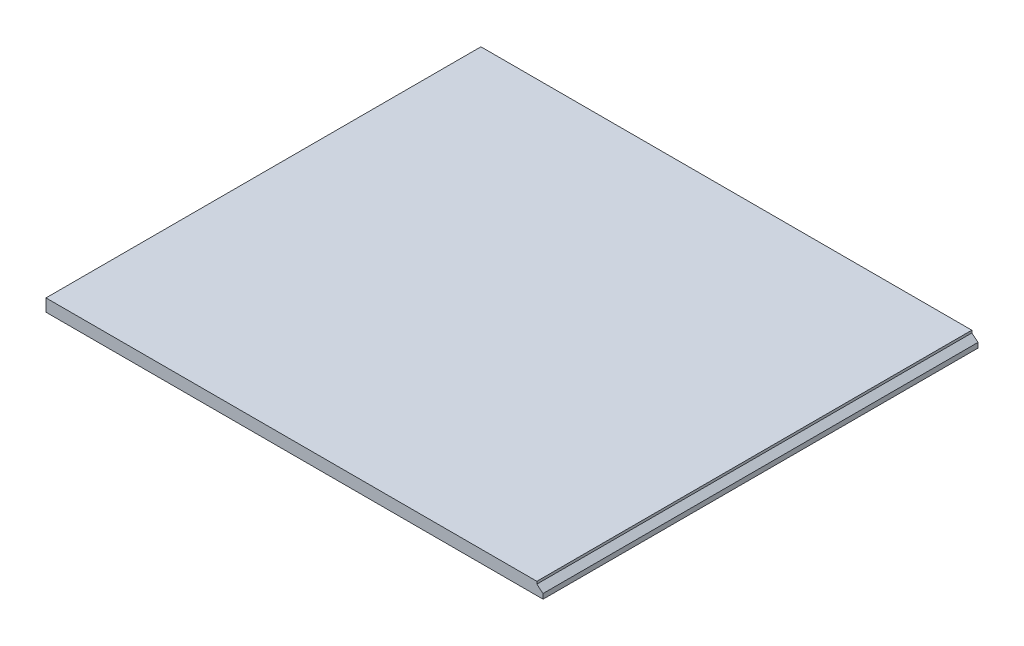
ISO-10303-21;
HEADER;
FILE_DESCRIPTION(('STEP AP214'),'2;1');
FILE_NAME('part.step','',(''),(''),'','','');
FILE_SCHEMA(('AUTOMOTIVE_DESIGN { 1 0 10303 214 1 1 1 1 }'));
ENDSEC;
DATA;
#1=APPLICATION_CONTEXT('core data for automotive mechanical design processes');
#2=APPLICATION_PROTOCOL_DEFINITION('international standard','automotive_design',2000,#1);
#3=PRODUCT_CONTEXT('',#1,'mechanical');
#4=PRODUCT('Part','Part','',(#3));
#5=PRODUCT_RELATED_PRODUCT_CATEGORY('part','',(#4));
#6=PRODUCT_DEFINITION_FORMATION('','',#4);
#7=PRODUCT_DEFINITION_CONTEXT('part definition',#1,'design');
#8=PRODUCT_DEFINITION('design','',#6,#7);
#9=PRODUCT_DEFINITION_SHAPE('','',#8);
#10=(LENGTH_UNIT() NAMED_UNIT(*) SI_UNIT(.MILLI.,.METRE.));
#11=(NAMED_UNIT(*) PLANE_ANGLE_UNIT() SI_UNIT($,.RADIAN.));
#12=(NAMED_UNIT(*) SI_UNIT($,.STERADIAN.) SOLID_ANGLE_UNIT());
#13=UNCERTAINTY_MEASURE_WITH_UNIT(LENGTH_MEASURE(1.E-05),#10,'distance_accuracy_value','');
#14=(GEOMETRIC_REPRESENTATION_CONTEXT(3) GLOBAL_UNCERTAINTY_ASSIGNED_CONTEXT((#13)) GLOBAL_UNIT_ASSIGNED_CONTEXT((#10,
#11,#12)) REPRESENTATION_CONTEXT('',''));
#15=CARTESIAN_POINT('',(0.,0.,0.));
#16=DIRECTION('',(0.,0.,1.));
#17=DIRECTION('',(1.,0.,0.));
#18=AXIS2_PLACEMENT_3D('',#15,#16,#17);
#19=CARTESIAN_POINT('',(1.22464679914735E-13,-1000.,5000.));
#20=DIRECTION('',(0.,1.,0.));
#21=DIRECTION('',(0.,0.,1.));
#22=AXIS2_PLACEMENT_3D('',#19,#20,#21);
#23=PLANE('',#22);
#24=DIRECTION('',(0.,0.,-1.));
#25=VECTOR('',#24,1.);
#26=CARTESIAN_POINT('',(1.22464679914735E-13,-1000.,5000.));
#27=LINE('',#26,#25);
#28=CARTESIAN_POINT('',(1.22464679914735E-13,-1000.,5000.));
#29=VERTEX_POINT('',#28);
#30=CARTESIAN_POINT('',(1.22464679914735E-13,-1000.,-30000.));
#31=VERTEX_POINT('',#30);
#32=EDGE_CURVE('E51',#29,#31,#27,.T.);
#33=ORIENTED_EDGE('',*,*,#32,.T.);
#34=DIRECTION('',(1.,0.,0.));
#35=VECTOR('',#34,1.);
#36=CARTESIAN_POINT('',(1.22464679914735E-13,-1000.,-30000.));
#37=LINE('',#36,#35);
#38=CARTESIAN_POINT('',(40000.,-1000.,-30000.));
#39=VERTEX_POINT('',#38);
#40=EDGE_CURVE('E165',#31,#39,#37,.T.);
#41=ORIENTED_EDGE('',*,*,#40,.T.);
#42=DIRECTION('',(0.,0.,-1.));
#43=VECTOR('',#42,1.);
#44=CARTESIAN_POINT('',(40000.,-1000.,5000.));
#45=LINE('',#44,#43);
#46=CARTESIAN_POINT('',(40000.,-1000.,5000.));
#47=VERTEX_POINT('',#46);
#48=EDGE_CURVE('E194',#47,#39,#45,.T.);
#49=ORIENTED_EDGE('',*,*,#48,.F.);
#50=DIRECTION('',(1.,0.,0.));
#51=VECTOR('',#50,1.);
#52=CARTESIAN_POINT('',(1.22464679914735E-13,-1000.,5000.));
#53=LINE('',#52,#51);
#54=EDGE_CURVE('E181',#29,#47,#53,.T.);
#55=ORIENTED_EDGE('',*,*,#54,.F.);
#56=EDGE_LOOP('',(#33,#41,#49,#55));
#57=FACE_BOUND('',#56,.T.);
#58=DIRECTION('',(0.,0.,1.));
#59=VECTOR('',#58,1.);
#60=CARTESIAN_POINT('',(4900.,-1000.,-14800.));
#61=LINE('',#60,#59);
#62=CARTESIAN_POINT('',(4900.,-1000.,-15200.));
#63=VERTEX_POINT('',#62);
#64=CARTESIAN_POINT('',(4900.,-1000.,-14800.));
#65=VERTEX_POINT('',#64);
#66=EDGE_CURVE('E58',#63,#65,#61,.T.);
#67=ORIENTED_EDGE('',*,*,#66,.T.);
#68=DIRECTION('',(1.,0.,0.));
#69=VECTOR('',#68,1.);
#70=CARTESIAN_POINT('',(4900.,-1000.,-14800.));
#71=LINE('',#70,#69);
#72=CARTESIAN_POINT('',(5000.,-1000.,-14800.));
#73=VERTEX_POINT('',#72);
#74=EDGE_CURVE('E152',#65,#73,#71,.T.);
#75=ORIENTED_EDGE('',*,*,#74,.T.);
#76=DIRECTION('',(0.,0.,-1.));
#77=VECTOR('',#76,1.);
#78=CARTESIAN_POINT('',(5000.,-1000.,-14800.));
#79=LINE('',#78,#77);
#80=CARTESIAN_POINT('',(5000.,-1000.,-14950.));
#81=VERTEX_POINT('',#80);
#82=EDGE_CURVE('E348',#73,#81,#79,.T.);
#83=ORIENTED_EDGE('',*,*,#82,.T.);
#84=CARTESIAN_POINT('',(5000.,-1000.,-15000.));
#85=DIRECTION('',(0.,1.,0.));
#86=DIRECTION('',(0.,0.,1.));
#87=AXIS2_PLACEMENT_3D('',#84,#85,#86);
#88=CIRCLE('',#87,50.0000000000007);
#89=CARTESIAN_POINT('',(5000.,-1000.,-15050.));
#90=VERTEX_POINT('',#89);
#91=EDGE_CURVE('E345',#81,#90,#88,.T.);
#92=ORIENTED_EDGE('',*,*,#91,.T.);
#93=DIRECTION('',(0.,0.,-1.));
#94=VECTOR('',#93,1.);
#95=CARTESIAN_POINT('',(5000.,-1000.,-15050.));
#96=LINE('',#95,#94);
#97=CARTESIAN_POINT('',(5000.,-1000.,-15200.));
#98=VERTEX_POINT('',#97);
#99=EDGE_CURVE('E339',#90,#98,#96,.T.);
#100=ORIENTED_EDGE('',*,*,#99,.T.);
#101=DIRECTION('',(-1.,0.,0.));
#102=VECTOR('',#101,1.);
#103=CARTESIAN_POINT('',(4900.,-1000.,-15200.));
#104=LINE('',#103,#102);
#105=EDGE_CURVE('E148',#98,#63,#104,.T.);
#106=ORIENTED_EDGE('',*,*,#105,.T.);
#107=EDGE_LOOP('',(#67,#75,#83,#92,#100,#106));
#108=FACE_BOUND('',#107,.T.);
#109=ADVANCED_FACE('F42',(#57,#108),#23,.F.);
#110=CARTESIAN_POINT('',(39500.,0.,5000.));
#111=DIRECTION('',(0.,-1.,0.));
#112=DIRECTION('',(0.,0.,-1.));
#113=AXIS2_PLACEMENT_3D('',#110,#111,#112);
#114=PLANE('',#113);
#115=DIRECTION('',(0.,0.,-1.));
#116=VECTOR('',#115,1.);
#117=CARTESIAN_POINT('',(39500.,0.,5000.));
#118=LINE('',#117,#116);
#119=CARTESIAN_POINT('',(39500.,0.,5000.));
#120=VERTEX_POINT('',#119);
#121=CARTESIAN_POINT('',(39500.,0.,-30000.));
#122=VERTEX_POINT('',#121);
#123=EDGE_CURVE('E188',#120,#122,#118,.T.);
#124=ORIENTED_EDGE('',*,*,#123,.T.);
#125=DIRECTION('',(-1.,0.,0.));
#126=VECTOR('',#125,1.);
#127=CARTESIAN_POINT('',(39500.,0.,-30000.));
#128=LINE('',#127,#126);
#129=CARTESIAN_POINT('',(0.,0.,-30000.));
#130=VERTEX_POINT('',#129);
#131=EDGE_CURVE('E153',#122,#130,#128,.T.);
#132=ORIENTED_EDGE('',*,*,#131,.T.);
#133=DIRECTION('',(0.,0.,-1.));
#134=VECTOR('',#133,1.);
#135=CARTESIAN_POINT('',(0.,0.,5000.));
#136=LINE('',#135,#134);
#137=CARTESIAN_POINT('',(0.,0.,5000.));
#138=VERTEX_POINT('',#137);
#139=EDGE_CURVE('E11',#138,#130,#136,.T.);
#140=ORIENTED_EDGE('',*,*,#139,.F.);
#141=DIRECTION('',(-1.,0.,0.));
#142=VECTOR('',#141,1.);
#143=CARTESIAN_POINT('',(39500.,0.,5000.));
#144=LINE('',#143,#142);
#145=EDGE_CURVE('E177',#120,#138,#144,.T.);
#146=ORIENTED_EDGE('',*,*,#145,.F.);
#147=EDGE_LOOP('',(#124,#132,#140,#146));
#148=FACE_BOUND('',#147,.T.);
#149=ADVANCED_FACE('F45',(#148),#114,.F.);
#150=CARTESIAN_POINT('',(0.,0.,5000.));
#151=DIRECTION('',(1.,0.,0.));
#152=DIRECTION('',(0.,1.,0.));
#153=AXIS2_PLACEMENT_3D('',#150,#151,#152);
#154=PLANE('',#153);
#155=ORIENTED_EDGE('',*,*,#139,.T.);
#156=DIRECTION('',(0.,-1.,0.));
#157=VECTOR('',#156,1.);
#158=CARTESIAN_POINT('',(0.,0.,-30000.));
#159=LINE('',#158,#157);
#160=EDGE_CURVE('E157',#130,#31,#159,.T.);
#161=ORIENTED_EDGE('',*,*,#160,.T.);
#162=ORIENTED_EDGE('',*,*,#32,.F.);
#163=DIRECTION('',(0.,-1.,0.));
#164=VECTOR('',#163,1.);
#165=CARTESIAN_POINT('',(0.,0.,5000.));
#166=LINE('',#165,#164);
#167=EDGE_CURVE('E179',#138,#29,#166,.T.);
#168=ORIENTED_EDGE('',*,*,#167,.F.);
#169=EDGE_LOOP('',(#155,#161,#162,#168));
#170=FACE_BOUND('',#169,.T.);
#171=ADVANCED_FACE('F208',(#170),#154,.F.);
#172=CARTESIAN_POINT('',(40000.,-1000.,5000.));
#173=DIRECTION('',(-1.,0.,0.));
#174=DIRECTION('',(0.,0.,1.));
#175=AXIS2_PLACEMENT_3D('',#172,#173,#174);
#176=PLANE('',#175);
#177=ORIENTED_EDGE('',*,*,#48,.T.);
#178=DIRECTION('',(0.,1.,0.));
#179=VECTOR('',#178,1.);
#180=CARTESIAN_POINT('',(40000.,-1000.,-30000.));
#181=LINE('',#180,#179);
#182=CARTESIAN_POINT('',(40000.,-600.,-30000.));
#183=VERTEX_POINT('',#182);
#184=EDGE_CURVE('E168',#39,#183,#181,.T.);
#185=ORIENTED_EDGE('',*,*,#184,.T.);
#186=DIRECTION('',(0.,0.,-1.));
#187=VECTOR('',#186,1.);
#188=CARTESIAN_POINT('',(40000.,-600.,5000.));
#189=LINE('',#188,#187);
#190=CARTESIAN_POINT('',(40000.,-600.,5000.));
#191=VERTEX_POINT('',#190);
#192=EDGE_CURVE('E192',#191,#183,#189,.T.);
#193=ORIENTED_EDGE('',*,*,#192,.F.);
#194=DIRECTION('',(0.,1.,0.));
#195=VECTOR('',#194,1.);
#196=CARTESIAN_POINT('',(40000.,-1000.,5000.));
#197=LINE('',#196,#195);
#198=EDGE_CURVE('E183',#47,#191,#197,.T.);
#199=ORIENTED_EDGE('',*,*,#198,.F.);
#200=EDGE_LOOP('',(#177,#185,#193,#199));
#201=FACE_BOUND('',#200,.T.);
#202=ADVANCED_FACE('F221',(#201),#176,.F.);
#203=CARTESIAN_POINT('',(39500.,-200.,5000.));
#204=DIRECTION('',(-0.624695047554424,-0.78086880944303,0.));
#205=DIRECTION('',(0.78086880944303,-0.624695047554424,0.));
#206=AXIS2_PLACEMENT_3D('',#203,#204,#205);
#207=PLANE('',#206);
#208=ORIENTED_EDGE('',*,*,#192,.T.);
#209=DIRECTION('',(-0.78086880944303,0.624695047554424,0.));
#210=VECTOR('',#209,1.);
#211=CARTESIAN_POINT('',(39500.,-200.,-30000.));
#212=LINE('',#211,#210);
#213=CARTESIAN_POINT('',(39500.,-200.,-30000.));
#214=VERTEX_POINT('',#213);
#215=EDGE_CURVE('E171',#183,#214,#212,.T.);
#216=ORIENTED_EDGE('',*,*,#215,.T.);
#217=DIRECTION('',(0.,0.,-1.));
#218=VECTOR('',#217,1.);
#219=CARTESIAN_POINT('',(39500.,-200.,5000.));
#220=LINE('',#219,#218);
#221=CARTESIAN_POINT('',(39500.,-200.,5000.));
#222=VERTEX_POINT('',#221);
#223=EDGE_CURVE('E190',#222,#214,#220,.T.);
#224=ORIENTED_EDGE('',*,*,#223,.F.);
#225=DIRECTION('',(-0.78086880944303,0.624695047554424,0.));
#226=VECTOR('',#225,1.);
#227=CARTESIAN_POINT('',(39500.,-200.,5000.));
#228=LINE('',#227,#226);
#229=EDGE_CURVE('E185',#191,#222,#228,.T.);
#230=ORIENTED_EDGE('',*,*,#229,.F.);
#231=EDGE_LOOP('',(#208,#216,#224,#230));
#232=FACE_BOUND('',#231,.T.);
#233=ADVANCED_FACE('F218',(#232),#207,.F.);
#234=CARTESIAN_POINT('',(39500.,0.,5000.));
#235=DIRECTION('',(-1.,0.,0.));
#236=DIRECTION('',(0.,0.,1.));
#237=AXIS2_PLACEMENT_3D('',#234,#235,#236);
#238=PLANE('',#237);
#239=ORIENTED_EDGE('',*,*,#223,.T.);
#240=DIRECTION('',(0.,1.,0.));
#241=VECTOR('',#240,1.);
#242=CARTESIAN_POINT('',(39500.,0.,-30000.));
#243=LINE('',#242,#241);
#244=EDGE_CURVE('E174',#214,#122,#243,.T.);
#245=ORIENTED_EDGE('',*,*,#244,.T.);
#246=ORIENTED_EDGE('',*,*,#123,.F.);
#247=DIRECTION('',(0.,1.,0.));
#248=VECTOR('',#247,1.);
#249=CARTESIAN_POINT('',(39500.,0.,5000.));
#250=LINE('',#249,#248);
#251=EDGE_CURVE('E66',#222,#120,#250,.T.);
#252=ORIENTED_EDGE('',*,*,#251,.F.);
#253=EDGE_LOOP('',(#239,#245,#246,#252));
#254=FACE_BOUND('',#253,.T.);
#255=ADVANCED_FACE('F214',(#254),#238,.F.);
#256=CARTESIAN_POINT('',(0.,0.,5000.));
#257=DIRECTION('',(0.,0.,1.));
#258=DIRECTION('',(1.,0.,0.));
#259=AXIS2_PLACEMENT_3D('',#256,#257,#258);
#260=PLANE('',#259);
#261=ORIENTED_EDGE('',*,*,#145,.T.);
#262=ORIENTED_EDGE('',*,*,#167,.T.);
#263=ORIENTED_EDGE('',*,*,#54,.T.);
#264=ORIENTED_EDGE('',*,*,#198,.T.);
#265=ORIENTED_EDGE('',*,*,#229,.T.);
#266=ORIENTED_EDGE('',*,*,#251,.T.);
#267=EDGE_LOOP('',(#261,#262,#263,#264,#265,#266));
#268=FACE_BOUND('',#267,.T.);
#269=ADVANCED_FACE('F223',(#268),#260,.T.);
#270=CARTESIAN_POINT('',(0.,0.,-30000.));
#271=DIRECTION('',(0.,0.,1.));
#272=DIRECTION('',(1.,0.,0.));
#273=AXIS2_PLACEMENT_3D('',#270,#271,#272);
#274=PLANE('',#273);
#275=ORIENTED_EDGE('',*,*,#131,.F.);
#276=ORIENTED_EDGE('',*,*,#244,.F.);
#277=ORIENTED_EDGE('',*,*,#215,.F.);
#278=ORIENTED_EDGE('',*,*,#184,.F.);
#279=ORIENTED_EDGE('',*,*,#40,.F.);
#280=ORIENTED_EDGE('',*,*,#160,.F.);
#281=EDGE_LOOP('',(#275,#276,#277,#278,#279,#280));
#282=FACE_BOUND('',#281,.T.);
#283=ADVANCED_FACE('F206',(#282),#274,.F.);
#284=CARTESIAN_POINT('',(4900.,-900.,-14800.));
#285=DIRECTION('',(1.,0.,0.));
#286=DIRECTION('',(0.,0.,-1.));
#287=AXIS2_PLACEMENT_3D('',#284,#285,#286);
#288=PLANE('',#287);
#289=ORIENTED_EDGE('',*,*,#66,.F.);
#290=DIRECTION('',(0.,-1.,0.));
#291=VECTOR('',#290,1.);
#292=CARTESIAN_POINT('',(4900.,-900.,-15200.));
#293=LINE('',#292,#291);
#294=CARTESIAN_POINT('',(4900.,-900.,-15200.));
#295=VERTEX_POINT('',#294);
#296=EDGE_CURVE('E147',#295,#63,#293,.T.);
#297=ORIENTED_EDGE('',*,*,#296,.F.);
#298=DIRECTION('',(0.,0.,1.));
#299=VECTOR('',#298,1.);
#300=CARTESIAN_POINT('',(4900.,-900.,-14800.));
#301=LINE('',#300,#299);
#302=CARTESIAN_POINT('',(4900.,-900.,-14800.));
#303=VERTEX_POINT('',#302);
#304=EDGE_CURVE('E138',#295,#303,#301,.T.);
#305=ORIENTED_EDGE('',*,*,#304,.T.);
#306=DIRECTION('',(0.,-1.,0.));
#307=VECTOR('',#306,1.);
#308=CARTESIAN_POINT('',(4900.,-900.,-14800.));
#309=LINE('',#308,#307);
#310=EDGE_CURVE('E146',#303,#65,#309,.T.);
#311=ORIENTED_EDGE('',*,*,#310,.T.);
#312=EDGE_LOOP('',(#289,#297,#305,#311));
#313=FACE_BOUND('',#312,.T.);
#314=ADVANCED_FACE('F145',(#313),#288,.T.);
#315=CARTESIAN_POINT('',(4900.,-900.,-14800.));
#316=DIRECTION('',(0.,0.,-1.));
#317=DIRECTION('',(-1.,0.,0.));
#318=AXIS2_PLACEMENT_3D('',#315,#316,#317);
#319=PLANE('',#318);
#320=ORIENTED_EDGE('',*,*,#74,.F.);
#321=ORIENTED_EDGE('',*,*,#310,.F.);
#322=DIRECTION('',(1.,0.,0.));
#323=VECTOR('',#322,1.);
#324=CARTESIAN_POINT('',(4900.,-900.,-14800.));
#325=LINE('',#324,#323);
#326=CARTESIAN_POINT('',(5000.,-900.,-14800.));
#327=VERTEX_POINT('',#326);
#328=EDGE_CURVE('E134',#303,#327,#325,.T.);
#329=ORIENTED_EDGE('',*,*,#328,.T.);
#330=DIRECTION('',(0.,-1.,0.));
#331=VECTOR('',#330,1.);
#332=CARTESIAN_POINT('',(5000.,-900.,-14800.));
#333=LINE('',#332,#331);
#334=EDGE_CURVE('E154',#327,#73,#333,.T.);
#335=ORIENTED_EDGE('',*,*,#334,.T.);
#336=EDGE_LOOP('',(#320,#321,#329,#335));
#337=FACE_BOUND('',#336,.T.);
#338=ADVANCED_FACE('F150',(#337),#319,.T.);
#339=CARTESIAN_POINT('',(5000.,-900.,-14800.));
#340=DIRECTION('',(-1.,0.,0.));
#341=DIRECTION('',(0.,0.,1.));
#342=AXIS2_PLACEMENT_3D('',#339,#340,#341);
#343=PLANE('',#342);
#344=ORIENTED_EDGE('',*,*,#82,.F.);
#345=ORIENTED_EDGE('',*,*,#334,.F.);
#346=DIRECTION('',(0.,0.,-1.));
#347=VECTOR('',#346,1.);
#348=CARTESIAN_POINT('',(5000.,-900.,-14800.));
#349=LINE('',#348,#347);
#350=CARTESIAN_POINT('',(5000.,-900.,-14950.));
#351=VERTEX_POINT('',#350);
#352=EDGE_CURVE('E140',#327,#351,#349,.T.);
#353=ORIENTED_EDGE('',*,*,#352,.T.);
#354=DIRECTION('',(0.,-1.,0.));
#355=VECTOR('',#354,1.);
#356=CARTESIAN_POINT('',(5000.,-900.,-14950.));
#357=LINE('',#356,#355);
#358=EDGE_CURVE('E159',#351,#81,#357,.T.);
#359=ORIENTED_EDGE('',*,*,#358,.T.);
#360=EDGE_LOOP('',(#344,#345,#353,#359));
#361=FACE_BOUND('',#360,.T.);
#362=ADVANCED_FACE('F283',(#361),#343,.T.);
#363=CARTESIAN_POINT('',(5000.,-900.,-15000.));
#364=DIRECTION('',(0.,-1.,0.));
#365=DIRECTION('',(0.,0.,-1.));
#366=AXIS2_PLACEMENT_3D('',#363,#364,#365);
#367=CYLINDRICAL_SURFACE('',#366,50.0000000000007);
#368=ORIENTED_EDGE('',*,*,#91,.F.);
#369=ORIENTED_EDGE('',*,*,#358,.F.);
#370=CARTESIAN_POINT('',(5000.,-900.,-15000.));
#371=DIRECTION('',(0.,1.,0.));
#372=DIRECTION('',(0.,0.,1.));
#373=AXIS2_PLACEMENT_3D('',#370,#371,#372);
#374=CIRCLE('',#373,50.0000000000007);
#375=CARTESIAN_POINT('',(5000.,-900.,-15050.));
#376=VERTEX_POINT('',#375);
#377=EDGE_CURVE('E364',#351,#376,#374,.T.);
#378=ORIENTED_EDGE('',*,*,#377,.T.);
#379=DIRECTION('',(0.,-1.,0.));
#380=VECTOR('',#379,1.);
#381=CARTESIAN_POINT('',(5000.,-900.,-15050.));
#382=LINE('',#381,#380);
#383=EDGE_CURVE('E355',#376,#90,#382,.T.);
#384=ORIENTED_EDGE('',*,*,#383,.T.);
#385=EDGE_LOOP('',(#368,#369,#378,#384));
#386=FACE_BOUND('',#385,.T.);
#387=ADVANCED_FACE('F292',(#386),#367,.F.);
#388=CARTESIAN_POINT('',(5000.,-900.,-15050.));
#389=DIRECTION('',(-1.,0.,0.));
#390=DIRECTION('',(0.,0.,1.));
#391=AXIS2_PLACEMENT_3D('',#388,#389,#390);
#392=PLANE('',#391);
#393=ORIENTED_EDGE('',*,*,#99,.F.);
#394=ORIENTED_EDGE('',*,*,#383,.F.);
#395=DIRECTION('',(0.,0.,-1.));
#396=VECTOR('',#395,1.);
#397=CARTESIAN_POINT('',(5000.,-900.,-15050.));
#398=LINE('',#397,#396);
#399=CARTESIAN_POINT('',(5000.,-900.,-15200.));
#400=VERTEX_POINT('',#399);
#401=EDGE_CURVE('E362',#376,#400,#398,.T.);
#402=ORIENTED_EDGE('',*,*,#401,.T.);
#403=DIRECTION('',(0.,-1.,0.));
#404=VECTOR('',#403,1.);
#405=CARTESIAN_POINT('',(5000.,-900.,-15200.));
#406=LINE('',#405,#404);
#407=EDGE_CURVE('E338',#400,#98,#406,.T.);
#408=ORIENTED_EDGE('',*,*,#407,.T.);
#409=EDGE_LOOP('',(#393,#394,#402,#408));
#410=FACE_BOUND('',#409,.T.);
#411=ADVANCED_FACE('F302',(#410),#392,.T.);
#412=CARTESIAN_POINT('',(4900.,-900.,-15200.));
#413=DIRECTION('',(0.,0.,1.));
#414=DIRECTION('',(1.,0.,0.));
#415=AXIS2_PLACEMENT_3D('',#412,#413,#414);
#416=PLANE('',#415);
#417=ORIENTED_EDGE('',*,*,#105,.F.);
#418=ORIENTED_EDGE('',*,*,#407,.F.);
#419=DIRECTION('',(-1.,0.,0.));
#420=VECTOR('',#419,1.);
#421=CARTESIAN_POINT('',(4900.,-900.,-15200.));
#422=LINE('',#421,#420);
#423=EDGE_CURVE('E353',#400,#295,#422,.T.);
#424=ORIENTED_EDGE('',*,*,#423,.T.);
#425=ORIENTED_EDGE('',*,*,#296,.T.);
#426=EDGE_LOOP('',(#417,#418,#424,#425));
#427=FACE_BOUND('',#426,.T.);
#428=ADVANCED_FACE('F312',(#427),#416,.T.);
#429=CARTESIAN_POINT('',(5000.,-900.,-15000.));
#430=DIRECTION('',(0.,1.,0.));
#431=DIRECTION('',(0.,0.,1.));
#432=AXIS2_PLACEMENT_3D('',#429,#430,#431);
#433=PLANE('',#432);
#434=ORIENTED_EDGE('',*,*,#304,.F.);
#435=ORIENTED_EDGE('',*,*,#423,.F.);
#436=ORIENTED_EDGE('',*,*,#401,.F.);
#437=ORIENTED_EDGE('',*,*,#377,.F.);
#438=ORIENTED_EDGE('',*,*,#352,.F.);
#439=ORIENTED_EDGE('',*,*,#328,.F.);
#440=EDGE_LOOP('',(#434,#435,#436,#437,#438,#439));
#441=FACE_BOUND('',#440,.T.);
#442=ADVANCED_FACE('F136',(#441),#433,.F.);
#443=CLOSED_SHELL('',(#109,#149,#171,#202,#233,#255,#269,#283,#314,#338,#362,#387,#411,#428,#442));
#444=MANIFOLD_SOLID_BREP('B2',#443);
#445=ADVANCED_BREP_SHAPE_REPRESENTATION('',(#18,#444),#14);
#446=SHAPE_DEFINITION_REPRESENTATION(#9,#445);
ENDSEC;
END-ISO-10303-21;
